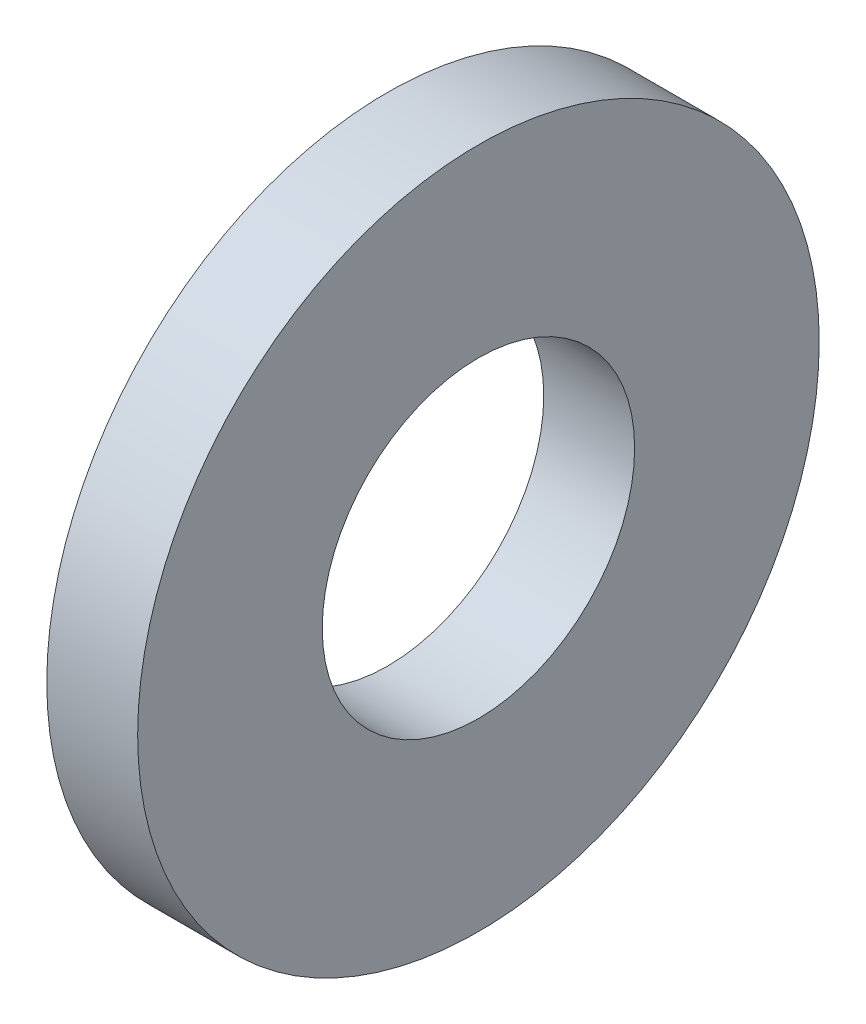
from build123d import *

# Parameters (mm, degrees)
SKETCH1_R          = 6
SKETCH1_R_2        = 2.75
BASE_EXTRUDE_DEPTH = 1.6


with BuildPart() as part:
    # Sketch1 → Base-Extrude (new body)
    with BuildSketch(Plane(origin=(0, 0, 0), x_dir=(0, 0, -1), z_dir=(1, 0, 0))):
        Circle(SKETCH1_R)
        Circle(SKETCH1_R_2, mode=Mode.SUBTRACT)
    extrude(amount=BASE_EXTRUDE_DEPTH)


solid = part.part
